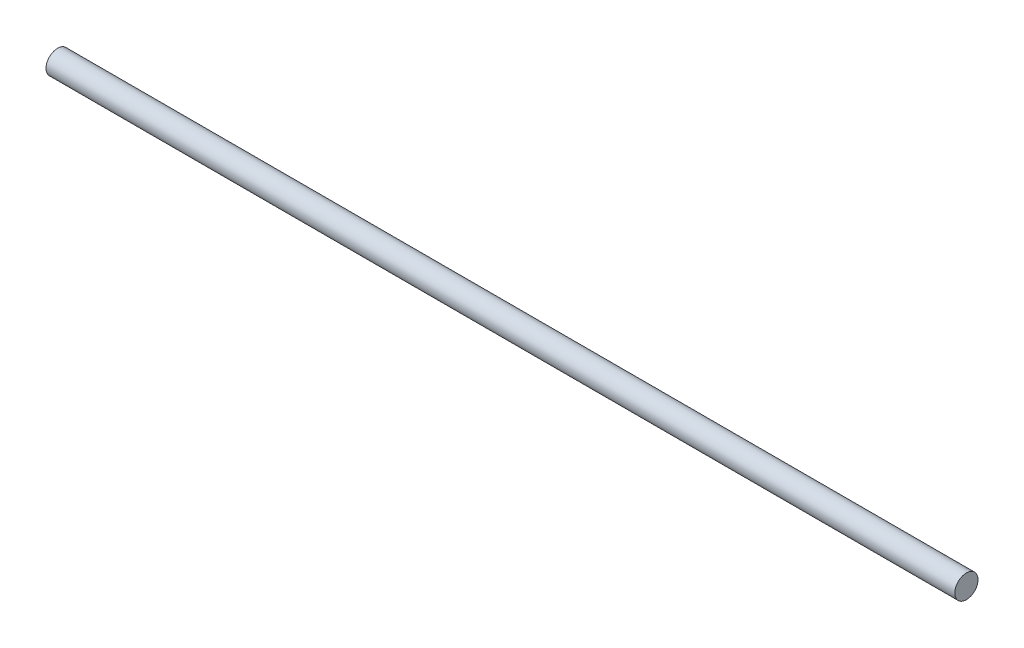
ISO-10303-21;
HEADER;
FILE_DESCRIPTION(('STEP AP214'),'2;1');
FILE_NAME('part.step','',(''),(''),'','','');
FILE_SCHEMA(('AUTOMOTIVE_DESIGN { 1 0 10303 214 1 1 1 1 }'));
ENDSEC;
DATA;
#1=APPLICATION_CONTEXT('core data for automotive mechanical design processes');
#2=APPLICATION_PROTOCOL_DEFINITION('international standard','automotive_design',2000,#1);
#3=PRODUCT_CONTEXT('',#1,'mechanical');
#4=PRODUCT('Part','Part','',(#3));
#5=PRODUCT_RELATED_PRODUCT_CATEGORY('part','',(#4));
#6=PRODUCT_DEFINITION_FORMATION('','',#4);
#7=PRODUCT_DEFINITION_CONTEXT('part definition',#1,'design');
#8=PRODUCT_DEFINITION('design','',#6,#7);
#9=PRODUCT_DEFINITION_SHAPE('','',#8);
#10=(LENGTH_UNIT() NAMED_UNIT(*) SI_UNIT(.MILLI.,.METRE.));
#11=(NAMED_UNIT(*) PLANE_ANGLE_UNIT() SI_UNIT($,.RADIAN.));
#12=(NAMED_UNIT(*) SI_UNIT($,.STERADIAN.) SOLID_ANGLE_UNIT());
#13=UNCERTAINTY_MEASURE_WITH_UNIT(LENGTH_MEASURE(1.E-05),#10,'distance_accuracy_value','');
#14=(GEOMETRIC_REPRESENTATION_CONTEXT(3) GLOBAL_UNCERTAINTY_ASSIGNED_CONTEXT((#13)) GLOBAL_UNIT_ASSIGNED_CONTEXT((#10,
#11,#12)) REPRESENTATION_CONTEXT('',''));
#15=CARTESIAN_POINT('',(0.,0.,0.));
#16=DIRECTION('',(0.,0.,1.));
#17=DIRECTION('',(1.,0.,0.));
#18=AXIS2_PLACEMENT_3D('',#15,#16,#17);
#19=CARTESIAN_POINT('',(0.,0.,0.));
#20=DIRECTION('',(1.,0.,0.));
#21=DIRECTION('',(0.,0.,-1.));
#22=AXIS2_PLACEMENT_3D('',#19,#20,#21);
#23=PLANE('',#22);
#24=CARTESIAN_POINT('',(0.,0.,0.));
#25=DIRECTION('',(-1.,0.,0.));
#26=DIRECTION('',(0.,0.,1.));
#27=AXIS2_PLACEMENT_3D('',#24,#25,#26);
#28=CIRCLE('',#27,3.9751);
#29=CARTESIAN_POINT('',(0.,0.,3.9751));
#30=VERTEX_POINT('',#29);
#31=EDGE_CURVE('E10',#30,#30,#28,.T.);
#32=ORIENTED_EDGE('',*,*,#31,.T.);
#33=EDGE_LOOP('',(#32));
#34=FACE_BOUND('',#33,.T.);
#35=ADVANCED_FACE('F31',(#34),#23,.F.);
#36=CARTESIAN_POINT('',(311.15,0.,0.));
#37=DIRECTION('',(-1.,0.,0.));
#38=DIRECTION('',(0.,0.,1.));
#39=AXIS2_PLACEMENT_3D('',#36,#37,#38);
#40=CYLINDRICAL_SURFACE('',#39,3.9751);
#41=ORIENTED_EDGE('',*,*,#31,.F.);
#42=EDGE_LOOP('',(#41));
#43=FACE_BOUND('',#42,.T.);
#44=CARTESIAN_POINT('',(311.15,0.,0.));
#45=DIRECTION('',(-1.,0.,0.));
#46=DIRECTION('',(0.,0.,1.));
#47=AXIS2_PLACEMENT_3D('',#44,#45,#46);
#48=CIRCLE('',#47,3.9751);
#49=CARTESIAN_POINT('',(311.15,0.,3.9751));
#50=VERTEX_POINT('',#49);
#51=EDGE_CURVE('E37',#50,#50,#48,.T.);
#52=ORIENTED_EDGE('',*,*,#51,.T.);
#53=EDGE_LOOP('',(#52));
#54=FACE_BOUND('',#53,.T.);
#55=ADVANCED_FACE('F43',(#43,#54),#40,.T.);
#56=CARTESIAN_POINT('',(311.15,3.9751,0.));
#57=DIRECTION('',(-1.,0.,0.));
#58=DIRECTION('',(0.,0.,1.));
#59=AXIS2_PLACEMENT_3D('',#56,#57,#58);
#60=PLANE('',#59);
#61=ORIENTED_EDGE('',*,*,#51,.F.);
#62=EDGE_LOOP('',(#61));
#63=FACE_BOUND('',#62,.T.);
#64=ADVANCED_FACE('F45',(#63),#60,.F.);
#65=CLOSED_SHELL('',(#35,#55,#64));
#66=MANIFOLD_SOLID_BREP('B2',#65);
#67=ADVANCED_BREP_SHAPE_REPRESENTATION('',(#18,#66),#14);
#68=SHAPE_DEFINITION_REPRESENTATION(#9,#67);
ENDSEC;
END-ISO-10303-21;
